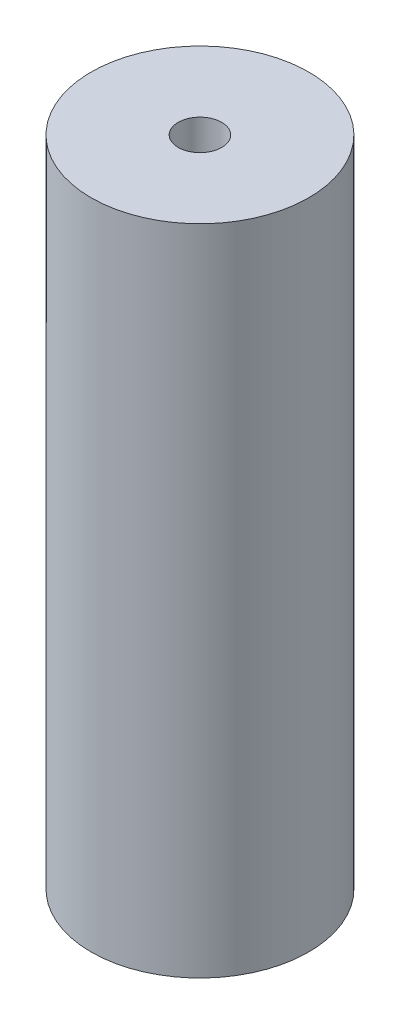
ISO-10303-21;
HEADER;
FILE_DESCRIPTION(('STEP AP214'),'2;1');
FILE_NAME('part.step','',(''),(''),'','','');
FILE_SCHEMA(('AUTOMOTIVE_DESIGN { 1 0 10303 214 1 1 1 1 }'));
ENDSEC;
DATA;
#1=APPLICATION_CONTEXT('core data for automotive mechanical design processes');
#2=APPLICATION_PROTOCOL_DEFINITION('international standard','automotive_design',2000,#1);
#3=PRODUCT_CONTEXT('',#1,'mechanical');
#4=PRODUCT('Part','Part','',(#3));
#5=PRODUCT_RELATED_PRODUCT_CATEGORY('part','',(#4));
#6=PRODUCT_DEFINITION_FORMATION('','',#4);
#7=PRODUCT_DEFINITION_CONTEXT('part definition',#1,'design');
#8=PRODUCT_DEFINITION('design','',#6,#7);
#9=PRODUCT_DEFINITION_SHAPE('','',#8);
#10=(LENGTH_UNIT() NAMED_UNIT(*) SI_UNIT(.MILLI.,.METRE.));
#11=(NAMED_UNIT(*) PLANE_ANGLE_UNIT() SI_UNIT($,.RADIAN.));
#12=(NAMED_UNIT(*) SI_UNIT($,.STERADIAN.) SOLID_ANGLE_UNIT());
#13=UNCERTAINTY_MEASURE_WITH_UNIT(LENGTH_MEASURE(1.E-05),#10,'distance_accuracy_value','');
#14=(GEOMETRIC_REPRESENTATION_CONTEXT(3) GLOBAL_UNCERTAINTY_ASSIGNED_CONTEXT((#13)) GLOBAL_UNIT_ASSIGNED_CONTEXT((#10,
#11,#12)) REPRESENTATION_CONTEXT('',''));
#15=CARTESIAN_POINT('',(0.,0.,0.));
#16=DIRECTION('',(0.,0.,1.));
#17=DIRECTION('',(1.,0.,0.));
#18=AXIS2_PLACEMENT_3D('',#15,#16,#17);
#19=CARTESIAN_POINT('',(0.,60.,0.));
#20=DIRECTION('',(0.,-1.,0.));
#21=DIRECTION('',(0.,0.,-1.));
#22=AXIS2_PLACEMENT_3D('',#19,#20,#21);
#23=CYLINDRICAL_SURFACE('',#22,10.);
#24=CARTESIAN_POINT('',(0.,60.,0.));
#25=DIRECTION('',(0.,1.,0.));
#26=DIRECTION('',(0.,0.,1.));
#27=AXIS2_PLACEMENT_3D('',#24,#25,#26);
#28=CIRCLE('',#27,10.);
#29=CARTESIAN_POINT('',(0.,60.,10.));
#30=VERTEX_POINT('',#29);
#31=EDGE_CURVE('E11',#30,#30,#28,.T.);
#32=ORIENTED_EDGE('',*,*,#31,.F.);
#33=EDGE_LOOP('',(#32));
#34=FACE_BOUND('',#33,.T.);
#35=CARTESIAN_POINT('',(0.,0.,0.));
#36=DIRECTION('',(0.,1.,0.));
#37=DIRECTION('',(0.,0.,1.));
#38=AXIS2_PLACEMENT_3D('',#35,#36,#37);
#39=CIRCLE('',#38,10.);
#40=CARTESIAN_POINT('',(0.,0.,10.));
#41=VERTEX_POINT('',#40);
#42=EDGE_CURVE('E35',#41,#41,#39,.T.);
#43=ORIENTED_EDGE('',*,*,#42,.T.);
#44=EDGE_LOOP('',(#43));
#45=FACE_BOUND('',#44,.T.);
#46=ADVANCED_FACE('F32',(#34,#45),#23,.T.);
#47=CARTESIAN_POINT('',(0.,60.,0.));
#48=DIRECTION('',(0.,1.,0.));
#49=DIRECTION('',(0.,0.,1.));
#50=AXIS2_PLACEMENT_3D('',#47,#48,#49);
#51=PLANE('',#50);
#52=CARTESIAN_POINT('',(0.,60.,0.));
#53=DIRECTION('',(0.,1.,0.));
#54=DIRECTION('',(0.,0.,1.));
#55=AXIS2_PLACEMENT_3D('',#52,#53,#54);
#56=CIRCLE('',#55,2.);
#57=CARTESIAN_POINT('',(0.,60.,2.));
#58=VERTEX_POINT('',#57);
#59=EDGE_CURVE('E51',#58,#58,#56,.T.);
#60=ORIENTED_EDGE('',*,*,#59,.F.);
#61=EDGE_LOOP('',(#60));
#62=FACE_BOUND('',#61,.T.);
#63=ORIENTED_EDGE('',*,*,#31,.T.);
#64=EDGE_LOOP('',(#63));
#65=FACE_BOUND('',#64,.T.);
#66=ADVANCED_FACE('F59',(#62,#65),#51,.T.);
#67=CARTESIAN_POINT('',(0.,0.,0.));
#68=DIRECTION('',(0.,1.,0.));
#69=DIRECTION('',(0.,0.,1.));
#70=AXIS2_PLACEMENT_3D('',#67,#68,#69);
#71=PLANE('',#70);
#72=ORIENTED_EDGE('',*,*,#42,.F.);
#73=EDGE_LOOP('',(#72));
#74=FACE_BOUND('',#73,.T.);
#75=ADVANCED_FACE('F45',(#74),#71,.F.);
#76=CARTESIAN_POINT('',(0.,35.,0.));
#77=DIRECTION('',(0.,1.,0.));
#78=DIRECTION('',(0.,0.,1.));
#79=AXIS2_PLACEMENT_3D('',#76,#77,#78);
#80=CONICAL_SURFACE('',#79,2.,1.02974425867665);
#81=CARTESIAN_POINT('',(0.,33.7982787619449,0.));
#82=VERTEX_POINT('',#81);
#83=VERTEX_LOOP('',#82);
#84=FACE_BOUND('',#83,.T.);
#85=CARTESIAN_POINT('',(0.,35.,0.));
#86=DIRECTION('',(0.,1.,0.));
#87=DIRECTION('',(0.,0.,1.));
#88=AXIS2_PLACEMENT_3D('',#85,#86,#87);
#89=CIRCLE('',#88,2.);
#90=CARTESIAN_POINT('',(0.,35.,2.));
#91=VERTEX_POINT('',#90);
#92=EDGE_CURVE('E49',#91,#91,#89,.T.);
#93=ORIENTED_EDGE('',*,*,#92,.T.);
#94=EDGE_LOOP('',(#93));
#95=FACE_BOUND('',#94,.T.);
#96=ADVANCED_FACE('F41',(#84,#95),#80,.F.);
#97=CARTESIAN_POINT('',(0.,60.,0.));
#98=DIRECTION('',(0.,1.,0.));
#99=DIRECTION('',(0.,0.,1.));
#100=AXIS2_PLACEMENT_3D('',#97,#98,#99);
#101=CYLINDRICAL_SURFACE('',#100,2.);
#102=ORIENTED_EDGE('',*,*,#92,.F.);
#103=EDGE_LOOP('',(#102));
#104=FACE_BOUND('',#103,.T.);
#105=ORIENTED_EDGE('',*,*,#59,.T.);
#106=EDGE_LOOP('',(#105));
#107=FACE_BOUND('',#106,.T.);
#108=ADVANCED_FACE('F44',(#104,#107),#101,.F.);
#109=CLOSED_SHELL('',(#46,#66,#75,#96,#108));
#110=MANIFOLD_SOLID_BREP('B2',#109);
#111=ADVANCED_BREP_SHAPE_REPRESENTATION('',(#18,#110),#14);
#112=SHAPE_DEFINITION_REPRESENTATION(#9,#111);
ENDSEC;
END-ISO-10303-21;
